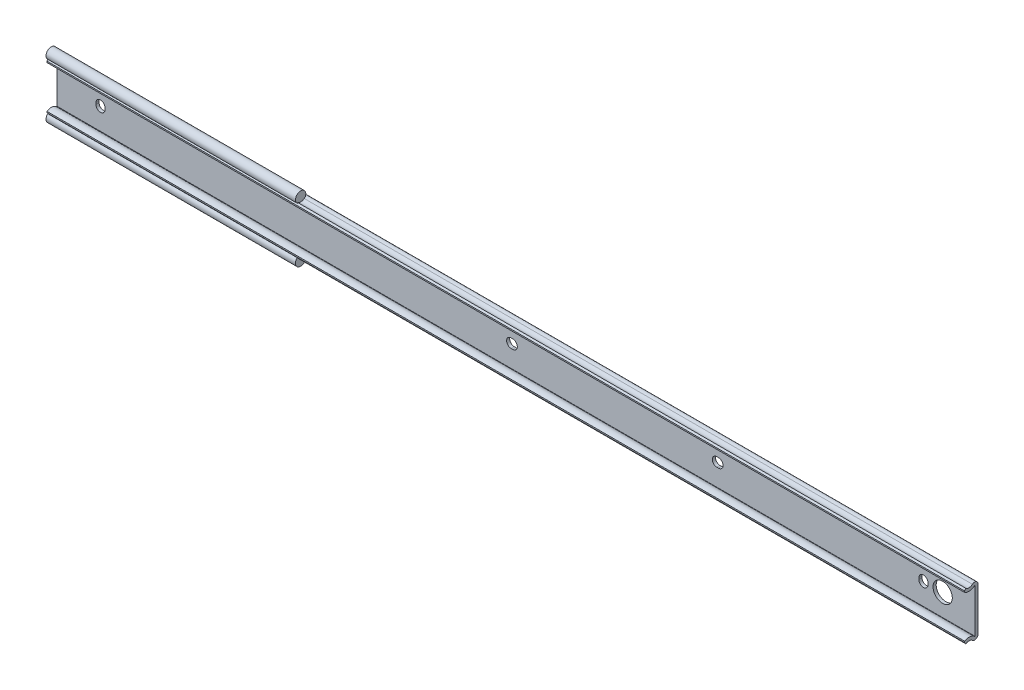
ISO-10303-21;
HEADER;
FILE_DESCRIPTION(('STEP AP214'),'2;1');
FILE_NAME('part.step','',(''),(''),'','','');
FILE_SCHEMA(('AUTOMOTIVE_DESIGN { 1 0 10303 214 1 1 1 1 }'));
ENDSEC;
DATA;
#1=APPLICATION_CONTEXT('core data for automotive mechanical design processes');
#2=APPLICATION_PROTOCOL_DEFINITION('international standard','automotive_design',2000,#1);
#3=PRODUCT_CONTEXT('',#1,'mechanical');
#4=PRODUCT('Part','Part','',(#3));
#5=PRODUCT_RELATED_PRODUCT_CATEGORY('part','',(#4));
#6=PRODUCT_DEFINITION_FORMATION('','',#4);
#7=PRODUCT_DEFINITION_CONTEXT('part definition',#1,'design');
#8=PRODUCT_DEFINITION('design','',#6,#7);
#9=PRODUCT_DEFINITION_SHAPE('','',#8);
#10=(LENGTH_UNIT() NAMED_UNIT(*) SI_UNIT(.MILLI.,.METRE.));
#11=(NAMED_UNIT(*) PLANE_ANGLE_UNIT() SI_UNIT($,.RADIAN.));
#12=(NAMED_UNIT(*) SI_UNIT($,.STERADIAN.) SOLID_ANGLE_UNIT());
#13=UNCERTAINTY_MEASURE_WITH_UNIT(LENGTH_MEASURE(1.E-05),#10,'distance_accuracy_value','');
#14=(GEOMETRIC_REPRESENTATION_CONTEXT(3) GLOBAL_UNCERTAINTY_ASSIGNED_CONTEXT((#13)) GLOBAL_UNIT_ASSIGNED_CONTEXT((#10,
#11,#12)) REPRESENTATION_CONTEXT('',''));
#15=CARTESIAN_POINT('',(0.,0.,0.));
#16=DIRECTION('',(0.,0.,1.));
#17=DIRECTION('',(1.,0.,0.));
#18=AXIS2_PLACEMENT_3D('',#15,#16,#17);
#19=CARTESIAN_POINT('',(105.8,13.575,4.5));
#20=DIRECTION('',(-1.,0.,0.));
#21=DIRECTION('',(0.,0.,1.));
#22=AXIS2_PLACEMENT_3D('',#19,#20,#21);
#23=CYLINDRICAL_SURFACE('',#22,2.55);
#24=DIRECTION('',(-1.,0.,0.));
#25=VECTOR('',#24,1.);
#26=CARTESIAN_POINT('',(105.8,11.6418409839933,6.16294805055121));
#27=LINE('',#26,#25);
#28=CARTESIAN_POINT('',(-21.4,11.6418409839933,6.16294805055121));
#29=VERTEX_POINT('',#28);
#30=CARTESIAN_POINT('',(101.8,11.6418409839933,6.16294805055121));
#31=VERTEX_POINT('',#30);
#32=EDGE_CURVE('E22',#29,#31,#27,.F.);
#33=ORIENTED_EDGE('',*,*,#32,.T.);
#34=CARTESIAN_POINT('',(101.8,13.575,4.5));
#35=DIRECTION('',(1.,0.,0.));
#36=DIRECTION('',(0.,0.,-1.));
#37=AXIS2_PLACEMENT_3D('',#34,#35,#36);
#38=CIRCLE('',#37,2.55);
#39=CARTESIAN_POINT('',(101.8,12.2965303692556,2.29364205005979));
#40=VERTEX_POINT('',#39);
#41=EDGE_CURVE('E244',#40,#31,#38,.T.);
#42=ORIENTED_EDGE('',*,*,#41,.F.);
#43=DIRECTION('',(-1.,0.,0.));
#44=VECTOR('',#43,1.);
#45=CARTESIAN_POINT('',(42.2,12.2965303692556,2.29364205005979));
#46=LINE('',#45,#44);
#47=CARTESIAN_POINT('',(-21.4,12.2965303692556,2.29364205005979));
#48=VERTEX_POINT('',#47);
#49=EDGE_CURVE('E457',#40,#48,#46,.T.);
#50=ORIENTED_EDGE('',*,*,#49,.T.);
#51=CARTESIAN_POINT('',(-21.4,13.575,4.5));
#52=DIRECTION('',(-1.,0.,0.));
#53=DIRECTION('',(0.,0.,1.));
#54=AXIS2_PLACEMENT_3D('',#51,#52,#53);
#55=CIRCLE('',#54,2.55);
#56=EDGE_CURVE('E253',#29,#48,#55,.T.);
#57=ORIENTED_EDGE('',*,*,#56,.F.);
#58=EDGE_LOOP('',(#33,#42,#50,#57));
#59=FACE_BOUND('',#58,.T.);
#60=ADVANCED_FACE('F14',(#59),#23,.T.);
#61=CARTESIAN_POINT('',(105.8,-13.575,4.5));
#62=DIRECTION('',(-1.,0.,0.));
#63=DIRECTION('',(0.,0.,1.));
#64=AXIS2_PLACEMENT_3D('',#61,#62,#63);
#65=CYLINDRICAL_SURFACE('',#64,2.55);
#66=DIRECTION('',(-1.,0.,0.));
#67=VECTOR('',#66,1.);
#68=CARTESIAN_POINT('',(42.2,-12.2965303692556,2.29364205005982));
#69=LINE('',#68,#67);
#70=CARTESIAN_POINT('',(-21.4,-12.2965303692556,2.29364205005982));
#71=VERTEX_POINT('',#70);
#72=CARTESIAN_POINT('',(101.8,-12.2965303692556,2.29364205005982));
#73=VERTEX_POINT('',#72);
#74=EDGE_CURVE('E480',#71,#73,#69,.F.);
#75=ORIENTED_EDGE('',*,*,#74,.T.);
#76=CARTESIAN_POINT('',(101.8,-13.575,4.5));
#77=DIRECTION('',(1.,0.,0.));
#78=DIRECTION('',(0.,0.,-1.));
#79=AXIS2_PLACEMENT_3D('',#76,#77,#78);
#80=CIRCLE('',#79,2.55);
#81=CARTESIAN_POINT('',(101.8,-11.641839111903,6.16294587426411));
#82=VERTEX_POINT('',#81);
#83=EDGE_CURVE('E492',#82,#73,#80,.T.);
#84=ORIENTED_EDGE('',*,*,#83,.F.);
#85=DIRECTION('',(-1.,0.,0.));
#86=VECTOR('',#85,1.);
#87=CARTESIAN_POINT('',(105.8,-11.641839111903,6.16294587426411));
#88=LINE('',#87,#86);
#89=CARTESIAN_POINT('',(-21.4,-11.641839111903,6.16294587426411));
#90=VERTEX_POINT('',#89);
#91=EDGE_CURVE('E9',#82,#90,#88,.T.);
#92=ORIENTED_EDGE('',*,*,#91,.T.);
#93=CARTESIAN_POINT('',(-21.4,-13.575,4.5));
#94=DIRECTION('',(-1.,0.,0.));
#95=DIRECTION('',(0.,0.,-1.));
#96=AXIS2_PLACEMENT_3D('',#93,#94,#95);
#97=CIRCLE('',#96,2.55);
#98=EDGE_CURVE('E483',#71,#90,#97,.T.);
#99=ORIENTED_EDGE('',*,*,#98,.F.);
#100=EDGE_LOOP('',(#75,#84,#92,#99));
#101=FACE_BOUND('',#100,.T.);
#102=ADVANCED_FACE('F514',(#101),#65,.T.);
#103=CARTESIAN_POINT('',(-21.4,13.9150000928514,4.44999970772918));
#104=DIRECTION('',(1.,0.,0.));
#105=DIRECTION('',(0.,0.,-1.));
#106=AXIS2_PLACEMENT_3D('',#103,#104,#105);
#107=CYLINDRICAL_SURFACE('',#106,2.55000008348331);
#108=DIRECTION('',(1.,0.,0.));
#109=VECTOR('',#108,1.);
#110=CARTESIAN_POINT('',(-21.4,12.0053612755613,2.76009438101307));
#111=LINE('',#110,#109);
#112=CARTESIAN_POINT('',(101.8,12.0053612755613,2.76009438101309));
#113=VERTEX_POINT('',#112);
#114=CARTESIAN_POINT('',(431.8,12.0053612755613,2.76009438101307));
#115=VERTEX_POINT('',#114);
#116=EDGE_CURVE('E297',#113,#115,#111,.T.);
#117=ORIENTED_EDGE('',*,*,#116,.F.);
#118=CARTESIAN_POINT('',(101.8,13.9150000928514,4.44999970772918));
#119=DIRECTION('',(1.,0.,0.));
#120=DIRECTION('',(0.,0.,-1.));
#121=AXIS2_PLACEMENT_3D('',#118,#119,#120);
#122=CIRCLE('',#121,2.5500000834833);
#123=CARTESIAN_POINT('',(101.8,11.8784794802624,5.98462807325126));
#124=VERTEX_POINT('',#123);
#125=EDGE_CURVE('E243',#124,#113,#122,.T.);
#126=ORIENTED_EDGE('',*,*,#125,.F.);
#127=DIRECTION('',(1.,0.,0.));
#128=VECTOR('',#127,1.);
#129=CARTESIAN_POINT('',(-21.4,11.8784794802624,5.98462807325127));
#130=LINE('',#129,#128);
#131=CARTESIAN_POINT('',(431.8,11.8784794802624,5.98462807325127));
#132=VERTEX_POINT('',#131);
#133=EDGE_CURVE('E241',#124,#132,#130,.T.);
#134=ORIENTED_EDGE('',*,*,#133,.T.);
#135=CARTESIAN_POINT('',(431.8,13.9150000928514,4.44999970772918));
#136=DIRECTION('',(-1.,0.,0.));
#137=DIRECTION('',(0.,0.,-1.));
#138=AXIS2_PLACEMENT_3D('',#135,#136,#137);
#139=CIRCLE('',#138,2.55000008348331);
#140=EDGE_CURVE('E391',#115,#132,#139,.T.);
#141=ORIENTED_EDGE('',*,*,#140,.F.);
#142=EDGE_LOOP('',(#117,#126,#134,#141));
#143=FACE_BOUND('',#142,.T.);
#144=ADVANCED_FACE('F512',(#143),#107,.F.);
#145=CARTESIAN_POINT('',(-21.4,10.762224,1.65999962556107));
#146=DIRECTION('',(1.,0.,0.));
#147=DIRECTION('',(0.,0.,-1.));
#148=AXIS2_PLACEMENT_3D('',#145,#146,#147);
#149=CYLINDRICAL_SURFACE('',#148,1.65999962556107);
#150=CARTESIAN_POINT('',(101.8,10.762224,1.65999962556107));
#151=DIRECTION('',(-1.,0.,0.));
#152=DIRECTION('',(0.,0.,-1.));
#153=AXIS2_PLACEMENT_3D('',#150,#151,#152);
#154=CIRCLE('',#153,1.65999962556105);
#155=EDGE_CURVE('E29',#113,#40,#154,.T.);
#156=ORIENTED_EDGE('',*,*,#155,.F.);
#157=ORIENTED_EDGE('',*,*,#116,.T.);
#158=CARTESIAN_POINT('',(431.8,10.762224,1.65999962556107));
#159=DIRECTION('',(1.,0.,0.));
#160=DIRECTION('',(0.,0.,-1.));
#161=AXIS2_PLACEMENT_3D('',#158,#159,#160);
#162=CIRCLE('',#161,1.65999962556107);
#163=CARTESIAN_POINT('',(431.8,10.762224,0.));
#164=VERTEX_POINT('',#163);
#165=EDGE_CURVE('E260',#164,#115,#162,.T.);
#166=ORIENTED_EDGE('',*,*,#165,.F.);
#167=DIRECTION('',(1.,0.,0.));
#168=VECTOR('',#167,1.);
#169=CARTESIAN_POINT('',(-21.4,10.762224,0.));
#170=LINE('',#169,#168);
#171=CARTESIAN_POINT('',(-21.4,10.762224,0.));
#172=VERTEX_POINT('',#171);
#173=EDGE_CURVE('E296',#172,#164,#170,.T.);
#174=ORIENTED_EDGE('',*,*,#173,.F.);
#175=CARTESIAN_POINT('',(-21.4,10.762224,1.65999962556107));
#176=DIRECTION('',(1.,0.,0.));
#177=DIRECTION('',(0.,0.,-1.));
#178=AXIS2_PLACEMENT_3D('',#175,#176,#177);
#179=CIRCLE('',#178,1.65999962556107);
#180=EDGE_CURVE('E352',#172,#48,#179,.T.);
#181=ORIENTED_EDGE('',*,*,#180,.T.);
#182=ORIENTED_EDGE('',*,*,#49,.F.);
#183=EDGE_LOOP('',(#156,#157,#166,#174,#181,#182));
#184=FACE_BOUND('',#183,.T.);
#185=ADVANCED_FACE('F16',(#184),#149,.T.);
#186=CARTESIAN_POINT('',(-21.4,-10.762224,0.));
#187=DIRECTION('',(0.,0.,-1.));
#188=DIRECTION('',(-1.,0.,0.));
#189=AXIS2_PLACEMENT_3D('',#186,#187,#188);
#190=PLANE('',#189);
#191=CARTESIAN_POINT('',(415.9,0.,0.));
#192=DIRECTION('',(0.,0.,-1.));
#193=DIRECTION('',(-1.,0.,0.));
#194=AXIS2_PLACEMENT_3D('',#191,#192,#193);
#195=CIRCLE('',#194,4.75);
#196=CARTESIAN_POINT('',(411.15,0.,0.));
#197=VERTEX_POINT('',#196);
#198=EDGE_CURVE('E261',#197,#197,#195,.T.);
#199=ORIENTED_EDGE('',*,*,#198,.F.);
#200=EDGE_LOOP('',(#199));
#201=FACE_BOUND('',#200,.T.);
#202=CARTESIAN_POINT('',(203.6,0.,0.));
#203=DIRECTION('',(0.,0.,-1.));
#204=DIRECTION('',(-1.,0.,0.));
#205=AXIS2_PLACEMENT_3D('',#202,#203,#204);
#206=CIRCLE('',#205,2.25);
#207=CARTESIAN_POINT('',(203.6,2.25,0.));
#208=VERTEX_POINT('',#207);
#209=CARTESIAN_POINT('',(203.6,-2.25,0.));
#210=VERTEX_POINT('',#209);
#211=EDGE_CURVE('E455',#208,#210,#206,.T.);
#212=ORIENTED_EDGE('',*,*,#211,.F.);
#213=DIRECTION('',(1.,0.,0.));
#214=VECTOR('',#213,1.);
#215=CARTESIAN_POINT('',(203.6,2.25,0.));
#216=LINE('',#215,#214);
#217=CARTESIAN_POINT('',(202.8,2.25,0.));
#218=VERTEX_POINT('',#217);
#219=EDGE_CURVE('E440',#218,#208,#216,.T.);
#220=ORIENTED_EDGE('',*,*,#219,.F.);
#221=CARTESIAN_POINT('',(202.8,0.,0.));
#222=DIRECTION('',(0.,0.,-1.));
#223=DIRECTION('',(-1.,0.,0.));
#224=AXIS2_PLACEMENT_3D('',#221,#222,#223);
#225=CIRCLE('',#224,2.25);
#226=CARTESIAN_POINT('',(202.8,-2.25,0.));
#227=VERTEX_POINT('',#226);
#228=EDGE_CURVE('E449',#227,#218,#225,.T.);
#229=ORIENTED_EDGE('',*,*,#228,.F.);
#230=DIRECTION('',(-1.,0.,0.));
#231=VECTOR('',#230,1.);
#232=CARTESIAN_POINT('',(203.6,-2.25,0.));
#233=LINE('',#232,#231);
#234=EDGE_CURVE('E452',#210,#227,#233,.T.);
#235=ORIENTED_EDGE('',*,*,#234,.F.);
#236=EDGE_LOOP('',(#212,#220,#229,#235));
#237=FACE_BOUND('',#236,.T.);
#238=CARTESIAN_POINT('',(305.2,0.,0.));
#239=DIRECTION('',(0.,0.,-1.));
#240=DIRECTION('',(-1.,0.,0.));
#241=AXIS2_PLACEMENT_3D('',#238,#239,#240);
#242=CIRCLE('',#241,2.25);
#243=CARTESIAN_POINT('',(305.2,2.25,0.));
#244=VERTEX_POINT('',#243);
#245=CARTESIAN_POINT('',(305.2,-2.25,0.));
#246=VERTEX_POINT('',#245);
#247=EDGE_CURVE('E446',#244,#246,#242,.T.);
#248=ORIENTED_EDGE('',*,*,#247,.F.);
#249=DIRECTION('',(1.,0.,0.));
#250=VECTOR('',#249,1.);
#251=CARTESIAN_POINT('',(305.2,2.25,0.));
#252=LINE('',#251,#250);
#253=CARTESIAN_POINT('',(304.4,2.25,0.));
#254=VERTEX_POINT('',#253);
#255=EDGE_CURVE('E462',#254,#244,#252,.T.);
#256=ORIENTED_EDGE('',*,*,#255,.F.);
#257=CARTESIAN_POINT('',(304.4,0.,0.));
#258=DIRECTION('',(0.,0.,-1.));
#259=DIRECTION('',(-1.,0.,0.));
#260=AXIS2_PLACEMENT_3D('',#257,#258,#259);
#261=CIRCLE('',#260,2.25);
#262=CARTESIAN_POINT('',(304.4,-2.25,0.));
#263=VERTEX_POINT('',#262);
#264=EDGE_CURVE('E469',#263,#254,#261,.T.);
#265=ORIENTED_EDGE('',*,*,#264,.F.);
#266=DIRECTION('',(-1.,0.,0.));
#267=VECTOR('',#266,1.);
#268=CARTESIAN_POINT('',(305.2,-2.25,0.));
#269=LINE('',#268,#267);
#270=EDGE_CURVE('E472',#246,#263,#269,.T.);
#271=ORIENTED_EDGE('',*,*,#270,.F.);
#272=EDGE_LOOP('',(#248,#256,#265,#271));
#273=FACE_BOUND('',#272,.T.);
#274=CARTESIAN_POINT('',(0.,0.4,0.));
#275=DIRECTION('',(0.,0.,-1.));
#276=DIRECTION('',(-1.,0.,0.));
#277=AXIS2_PLACEMENT_3D('',#274,#275,#276);
#278=CIRCLE('',#277,2.24999999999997);
#279=CARTESIAN_POINT('',(-2.24999999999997,0.4,0.));
#280=VERTEX_POINT('',#279);
#281=CARTESIAN_POINT('',(2.24999999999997,0.4,0.));
#282=VERTEX_POINT('',#281);
#283=EDGE_CURVE('E414',#280,#282,#278,.T.);
#284=ORIENTED_EDGE('',*,*,#283,.F.);
#285=DIRECTION('',(0.,1.,0.));
#286=VECTOR('',#285,1.);
#287=CARTESIAN_POINT('',(-2.24999999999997,0.4,0.));
#288=LINE('',#287,#286);
#289=CARTESIAN_POINT('',(-2.24999999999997,-0.4,0.));
#290=VERTEX_POINT('',#289);
#291=EDGE_CURVE('E399',#290,#280,#288,.T.);
#292=ORIENTED_EDGE('',*,*,#291,.F.);
#293=CARTESIAN_POINT('',(0.,-0.4,0.));
#294=DIRECTION('',(0.,0.,-1.));
#295=DIRECTION('',(-1.,0.,0.));
#296=AXIS2_PLACEMENT_3D('',#293,#294,#295);
#297=CIRCLE('',#296,2.24999999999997);
#298=CARTESIAN_POINT('',(2.24999999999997,-0.4,0.));
#299=VERTEX_POINT('',#298);
#300=EDGE_CURVE('E408',#299,#290,#297,.T.);
#301=ORIENTED_EDGE('',*,*,#300,.F.);
#302=DIRECTION('',(0.,-1.,0.));
#303=VECTOR('',#302,1.);
#304=CARTESIAN_POINT('',(2.24999999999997,0.4,0.));
#305=LINE('',#304,#303);
#306=EDGE_CURVE('E411',#282,#299,#305,.T.);
#307=ORIENTED_EDGE('',*,*,#306,.F.);
#308=EDGE_LOOP('',(#284,#292,#301,#307));
#309=FACE_BOUND('',#308,.T.);
#310=CARTESIAN_POINT('',(406.4,0.4,0.));
#311=DIRECTION('',(0.,0.,-1.));
#312=DIRECTION('',(-1.,0.,0.));
#313=AXIS2_PLACEMENT_3D('',#310,#311,#312);
#314=CIRCLE('',#313,2.25);
#315=CARTESIAN_POINT('',(404.15,0.4,0.));
#316=VERTEX_POINT('',#315);
#317=CARTESIAN_POINT('',(408.65,0.4,0.));
#318=VERTEX_POINT('',#317);
#319=EDGE_CURVE('E405',#316,#318,#314,.T.);
#320=ORIENTED_EDGE('',*,*,#319,.F.);
#321=DIRECTION('',(0.,1.,0.));
#322=VECTOR('',#321,1.);
#323=CARTESIAN_POINT('',(404.15,0.4,0.));
#324=LINE('',#323,#322);
#325=CARTESIAN_POINT('',(404.15,-0.4,0.));
#326=VERTEX_POINT('',#325);
#327=EDGE_CURVE('E421',#326,#316,#324,.T.);
#328=ORIENTED_EDGE('',*,*,#327,.F.);
#329=CARTESIAN_POINT('',(406.4,-0.4,0.));
#330=DIRECTION('',(0.,0.,-1.));
#331=DIRECTION('',(-1.,0.,0.));
#332=AXIS2_PLACEMENT_3D('',#329,#330,#331);
#333=CIRCLE('',#332,2.25);
#334=CARTESIAN_POINT('',(408.65,-0.4,0.));
#335=VERTEX_POINT('',#334);
#336=EDGE_CURVE('E429',#335,#326,#333,.T.);
#337=ORIENTED_EDGE('',*,*,#336,.F.);
#338=DIRECTION('',(0.,-1.,0.));
#339=VECTOR('',#338,1.);
#340=CARTESIAN_POINT('',(408.65,0.4,0.));
#341=LINE('',#340,#339);
#342=EDGE_CURVE('E432',#318,#335,#341,.T.);
#343=ORIENTED_EDGE('',*,*,#342,.F.);
#344=EDGE_LOOP('',(#320,#328,#337,#343));
#345=FACE_BOUND('',#344,.T.);
#346=DIRECTION('',(0.,1.,0.));
#347=VECTOR('',#346,1.);
#348=CARTESIAN_POINT('',(-21.4,-10.762224,0.));
#349=LINE('',#348,#347);
#350=CARTESIAN_POINT('',(-21.4,-10.762224,0.));
#351=VERTEX_POINT('',#350);
#352=EDGE_CURVE('E300',#351,#172,#349,.T.);
#353=ORIENTED_EDGE('',*,*,#352,.T.);
#354=ORIENTED_EDGE('',*,*,#173,.T.);
#355=DIRECTION('',(0.,1.,0.));
#356=VECTOR('',#355,1.);
#357=CARTESIAN_POINT('',(431.8,-10.762224,0.));
#358=LINE('',#357,#356);
#359=CARTESIAN_POINT('',(431.8,-10.762224,0.));
#360=VERTEX_POINT('',#359);
#361=EDGE_CURVE('E355',#360,#164,#358,.T.);
#362=ORIENTED_EDGE('',*,*,#361,.F.);
#363=DIRECTION('',(1.,0.,0.));
#364=VECTOR('',#363,1.);
#365=CARTESIAN_POINT('',(-21.4,-10.762224,0.));
#366=LINE('',#365,#364);
#367=EDGE_CURVE('E322',#351,#360,#366,.T.);
#368=ORIENTED_EDGE('',*,*,#367,.F.);
#369=EDGE_LOOP('',(#353,#354,#362,#368));
#370=FACE_BOUND('',#369,.T.);
#371=ADVANCED_FACE('F520',(#201,#237,#273,#309,#345,#370),#190,.T.);
#372=CARTESIAN_POINT('',(-21.4,-10.762224,1.65999962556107));
#373=DIRECTION('',(1.,0.,0.));
#374=DIRECTION('',(0.,0.,-1.));
#375=AXIS2_PLACEMENT_3D('',#372,#373,#374);
#376=CYLINDRICAL_SURFACE('',#375,1.65999962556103);
#377=ORIENTED_EDGE('',*,*,#74,.F.);
#378=CARTESIAN_POINT('',(-21.4,-10.762224,1.65999962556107));
#379=DIRECTION('',(1.,0.,0.));
#380=DIRECTION('',(0.,0.,1.));
#381=AXIS2_PLACEMENT_3D('',#378,#379,#380);
#382=CIRCLE('',#381,1.65999962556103);
#383=EDGE_CURVE('E37',#71,#351,#382,.T.);
#384=ORIENTED_EDGE('',*,*,#383,.T.);
#385=ORIENTED_EDGE('',*,*,#367,.T.);
#386=CARTESIAN_POINT('',(431.8,-10.762224,1.65999962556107));
#387=DIRECTION('',(1.,0.,0.));
#388=DIRECTION('',(0.,0.,1.));
#389=AXIS2_PLACEMENT_3D('',#386,#387,#388);
#390=CIRCLE('',#389,1.65999962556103);
#391=CARTESIAN_POINT('',(431.8,-12.0036867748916,2.76198371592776));
#392=VERTEX_POINT('',#391);
#393=EDGE_CURVE('E358',#392,#360,#390,.T.);
#394=ORIENTED_EDGE('',*,*,#393,.F.);
#395=DIRECTION('',(1.,0.,0.));
#396=VECTOR('',#395,1.);
#397=CARTESIAN_POINT('',(-21.4,-12.0036867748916,2.76198371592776));
#398=LINE('',#397,#396);
#399=CARTESIAN_POINT('',(101.8,-12.0036867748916,2.76198371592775));
#400=VERTEX_POINT('',#399);
#401=EDGE_CURVE('E320',#400,#392,#398,.T.);
#402=ORIENTED_EDGE('',*,*,#401,.F.);
#403=CARTESIAN_POINT('',(101.8,-10.762224,1.65999962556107));
#404=DIRECTION('',(-1.,0.,0.));
#405=DIRECTION('',(0.,0.,-1.));
#406=AXIS2_PLACEMENT_3D('',#403,#404,#405);
#407=CIRCLE('',#406,1.65999962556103);
#408=EDGE_CURVE('E489',#73,#400,#407,.T.);
#409=ORIENTED_EDGE('',*,*,#408,.F.);
#410=EDGE_LOOP('',(#377,#384,#385,#394,#402,#409));
#411=FACE_BOUND('',#410,.T.);
#412=ADVANCED_FACE('F607',(#411),#376,.T.);
#413=CARTESIAN_POINT('',(-21.4,-10.7845049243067,1.54999983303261));
#414=DIRECTION('',(0.,0.,1.));
#415=DIRECTION('',(0.,-1.,0.));
#416=AXIS2_PLACEMENT_3D('',#413,#414,#415);
#417=PLANE('',#416);
#418=CARTESIAN_POINT('',(415.9,0.,1.54999983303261));
#419=DIRECTION('',(0.,0.,1.));
#420=DIRECTION('',(0.,-1.,0.));
#421=AXIS2_PLACEMENT_3D('',#418,#419,#420);
#422=CIRCLE('',#421,4.75);
#423=CARTESIAN_POINT('',(415.9,-4.75,1.54999983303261));
#424=VERTEX_POINT('',#423);
#425=EDGE_CURVE('E258',#424,#424,#422,.T.);
#426=ORIENTED_EDGE('',*,*,#425,.F.);
#427=EDGE_LOOP('',(#426));
#428=FACE_BOUND('',#427,.T.);
#429=CARTESIAN_POINT('',(203.6,0.,1.54999983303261));
#430=DIRECTION('',(0.,0.,1.));
#431=DIRECTION('',(0.,-1.,0.));
#432=AXIS2_PLACEMENT_3D('',#429,#430,#431);
#433=CIRCLE('',#432,2.25);
#434=CARTESIAN_POINT('',(203.6,-2.25,1.54999983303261));
#435=VERTEX_POINT('',#434);
#436=CARTESIAN_POINT('',(203.6,2.25,1.54999983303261));
#437=VERTEX_POINT('',#436);
#438=EDGE_CURVE('E254',#435,#437,#433,.T.);
#439=ORIENTED_EDGE('',*,*,#438,.F.);
#440=DIRECTION('',(1.,0.,0.));
#441=VECTOR('',#440,1.);
#442=CARTESIAN_POINT('',(-21.4,-2.25,1.54999983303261));
#443=LINE('',#442,#441);
#444=CARTESIAN_POINT('',(202.8,-2.25,1.54999983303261));
#445=VERTEX_POINT('',#444);
#446=EDGE_CURVE('E267',#445,#435,#443,.T.);
#447=ORIENTED_EDGE('',*,*,#446,.F.);
#448=CARTESIAN_POINT('',(202.8,0.,1.54999983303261));
#449=DIRECTION('',(0.,0.,1.));
#450=DIRECTION('',(0.,-1.,0.));
#451=AXIS2_PLACEMENT_3D('',#448,#449,#450);
#452=CIRCLE('',#451,2.25);
#453=CARTESIAN_POINT('',(202.8,2.25,1.54999983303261));
#454=VERTEX_POINT('',#453);
#455=EDGE_CURVE('E264',#454,#445,#452,.T.);
#456=ORIENTED_EDGE('',*,*,#455,.F.);
#457=DIRECTION('',(-1.,0.,0.));
#458=VECTOR('',#457,1.);
#459=CARTESIAN_POINT('',(-21.4,2.25,1.54999983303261));
#460=LINE('',#459,#458);
#461=EDGE_CURVE('E255',#437,#454,#460,.T.);
#462=ORIENTED_EDGE('',*,*,#461,.F.);
#463=EDGE_LOOP('',(#439,#447,#456,#462));
#464=FACE_BOUND('',#463,.T.);
#465=CARTESIAN_POINT('',(305.2,0.,1.54999983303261));
#466=DIRECTION('',(0.,0.,1.));
#467=DIRECTION('',(0.,-1.,0.));
#468=AXIS2_PLACEMENT_3D('',#465,#466,#467);
#469=CIRCLE('',#468,2.25);
#470=CARTESIAN_POINT('',(305.2,-2.25,1.54999983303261));
#471=VERTEX_POINT('',#470);
#472=CARTESIAN_POINT('',(305.2,2.25,1.54999983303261));
#473=VERTEX_POINT('',#472);
#474=EDGE_CURVE('E269',#471,#473,#469,.T.);
#475=ORIENTED_EDGE('',*,*,#474,.F.);
#476=DIRECTION('',(1.,0.,0.));
#477=VECTOR('',#476,1.);
#478=CARTESIAN_POINT('',(-21.4,-2.25,1.54999983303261));
#479=LINE('',#478,#477);
#480=CARTESIAN_POINT('',(304.4,-2.25,1.54999983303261));
#481=VERTEX_POINT('',#480);
#482=EDGE_CURVE('E276',#481,#471,#479,.T.);
#483=ORIENTED_EDGE('',*,*,#482,.F.);
#484=CARTESIAN_POINT('',(304.4,0.,1.54999983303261));
#485=DIRECTION('',(0.,0.,1.));
#486=DIRECTION('',(0.,-1.,0.));
#487=AXIS2_PLACEMENT_3D('',#484,#485,#486);
#488=CIRCLE('',#487,2.25);
#489=CARTESIAN_POINT('',(304.4,2.25,1.54999983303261));
#490=VERTEX_POINT('',#489);
#491=EDGE_CURVE('E273',#490,#481,#488,.T.);
#492=ORIENTED_EDGE('',*,*,#491,.F.);
#493=DIRECTION('',(-1.,0.,0.));
#494=VECTOR('',#493,1.);
#495=CARTESIAN_POINT('',(-21.4,2.25000000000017,1.54999983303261));
#496=LINE('',#495,#494);
#497=EDGE_CURVE('E271',#473,#490,#496,.T.);
#498=ORIENTED_EDGE('',*,*,#497,.F.);
#499=EDGE_LOOP('',(#475,#483,#492,#498));
#500=FACE_BOUND('',#499,.T.);
#501=CARTESIAN_POINT('',(0.,0.4,1.54999983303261));
#502=DIRECTION('',(0.,0.,1.));
#503=DIRECTION('',(0.,-1.,0.));
#504=AXIS2_PLACEMENT_3D('',#501,#502,#503);
#505=CIRCLE('',#504,2.24999999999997);
#506=CARTESIAN_POINT('',(2.24999999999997,0.4,1.54999983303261));
#507=VERTEX_POINT('',#506);
#508=CARTESIAN_POINT('',(-2.24999999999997,0.4,1.54999983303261));
#509=VERTEX_POINT('',#508);
#510=EDGE_CURVE('E278',#507,#509,#505,.T.);
#511=ORIENTED_EDGE('',*,*,#510,.F.);
#512=DIRECTION('',(0.,1.,0.));
#513=VECTOR('',#512,1.);
#514=CARTESIAN_POINT('',(2.24999999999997,-10.7845049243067,1.54999983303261));
#515=LINE('',#514,#513);
#516=CARTESIAN_POINT('',(2.24999999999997,-0.4,1.54999983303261));
#517=VERTEX_POINT('',#516);
#518=EDGE_CURVE('E285',#517,#507,#515,.T.);
#519=ORIENTED_EDGE('',*,*,#518,.F.);
#520=CARTESIAN_POINT('',(0.,-0.4,1.54999983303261));
#521=DIRECTION('',(0.,0.,1.));
#522=DIRECTION('',(0.,-1.,0.));
#523=AXIS2_PLACEMENT_3D('',#520,#521,#522);
#524=CIRCLE('',#523,2.24999999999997);
#525=CARTESIAN_POINT('',(-2.24999999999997,-0.4,1.54999983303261));
#526=VERTEX_POINT('',#525);
#527=EDGE_CURVE('E282',#526,#517,#524,.T.);
#528=ORIENTED_EDGE('',*,*,#527,.F.);
#529=DIRECTION('',(0.,-1.,0.));
#530=VECTOR('',#529,1.);
#531=CARTESIAN_POINT('',(-2.24999999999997,-10.7845049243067,1.54999983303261));
#532=LINE('',#531,#530);
#533=EDGE_CURVE('E280',#509,#526,#532,.T.);
#534=ORIENTED_EDGE('',*,*,#533,.F.);
#535=EDGE_LOOP('',(#511,#519,#528,#534));
#536=FACE_BOUND('',#535,.T.);
#537=CARTESIAN_POINT('',(406.4,0.4,1.54999983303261));
#538=DIRECTION('',(0.,0.,1.));
#539=DIRECTION('',(0.,-1.,0.));
#540=AXIS2_PLACEMENT_3D('',#537,#538,#539);
#541=CIRCLE('',#540,2.25);
#542=CARTESIAN_POINT('',(408.65,0.4,1.54999983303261));
#543=VERTEX_POINT('',#542);
#544=CARTESIAN_POINT('',(404.15,0.4,1.54999983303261));
#545=VERTEX_POINT('',#544);
#546=EDGE_CURVE('E287',#543,#545,#541,.T.);
#547=ORIENTED_EDGE('',*,*,#546,.F.);
#548=DIRECTION('',(0.,1.,0.));
#549=VECTOR('',#548,1.);
#550=CARTESIAN_POINT('',(408.65,-10.7845049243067,1.54999983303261));
#551=LINE('',#550,#549);
#552=CARTESIAN_POINT('',(408.65,-0.4,1.54999983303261));
#553=VERTEX_POINT('',#552);
#554=EDGE_CURVE('E294',#553,#543,#551,.T.);
#555=ORIENTED_EDGE('',*,*,#554,.F.);
#556=CARTESIAN_POINT('',(406.4,-0.4,1.54999983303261));
#557=DIRECTION('',(0.,0.,1.));
#558=DIRECTION('',(0.,-1.,0.));
#559=AXIS2_PLACEMENT_3D('',#556,#557,#558);
#560=CIRCLE('',#559,2.25);
#561=CARTESIAN_POINT('',(404.15,-0.4,1.54999983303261));
#562=VERTEX_POINT('',#561);
#563=EDGE_CURVE('E291',#562,#553,#560,.T.);
#564=ORIENTED_EDGE('',*,*,#563,.F.);
#565=DIRECTION('',(0.,-1.,0.));
#566=VECTOR('',#565,1.);
#567=CARTESIAN_POINT('',(404.15,-10.7845049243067,1.54999983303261));
#568=LINE('',#567,#566);
#569=EDGE_CURVE('E289',#545,#562,#568,.T.);
#570=ORIENTED_EDGE('',*,*,#569,.F.);
#571=EDGE_LOOP('',(#547,#555,#564,#570));
#572=FACE_BOUND('',#571,.T.);
#573=DIRECTION('',(0.,-1.,0.));
#574=VECTOR('',#573,1.);
#575=CARTESIAN_POINT('',(-21.4,-10.7845049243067,1.54999983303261));
#576=LINE('',#575,#574);
#577=CARTESIAN_POINT('',(-21.4,10.7845049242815,1.54999983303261));
#578=VERTEX_POINT('',#577);
#579=CARTESIAN_POINT('',(-21.4,-10.7845049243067,1.54999983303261));
#580=VERTEX_POINT('',#579);
#581=EDGE_CURVE('E339',#578,#580,#576,.T.);
#582=ORIENTED_EDGE('',*,*,#581,.T.);
#583=DIRECTION('',(1.,0.,0.));
#584=VECTOR('',#583,1.);
#585=CARTESIAN_POINT('',(-21.4,-10.7845049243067,1.54999983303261));
#586=LINE('',#585,#584);
#587=CARTESIAN_POINT('',(431.8,-10.7845049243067,1.54999983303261));
#588=VERTEX_POINT('',#587);
#589=EDGE_CURVE('E310',#580,#588,#586,.T.);
#590=ORIENTED_EDGE('',*,*,#589,.T.);
#591=DIRECTION('',(0.,-1.,0.));
#592=VECTOR('',#591,1.);
#593=CARTESIAN_POINT('',(431.8,-10.7845049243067,1.54999983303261));
#594=LINE('',#593,#592);
#595=CARTESIAN_POINT('',(431.8,10.7845049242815,1.54999983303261));
#596=VERTEX_POINT('',#595);
#597=EDGE_CURVE('E376',#596,#588,#594,.T.);
#598=ORIENTED_EDGE('',*,*,#597,.F.);
#599=DIRECTION('',(1.,0.,0.));
#600=VECTOR('',#599,1.);
#601=CARTESIAN_POINT('',(-21.4,10.7845049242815,1.54999983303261));
#602=LINE('',#601,#600);
#603=EDGE_CURVE('E308',#578,#596,#602,.T.);
#604=ORIENTED_EDGE('',*,*,#603,.F.);
#605=EDGE_LOOP('',(#582,#590,#598,#604));
#606=FACE_BOUND('',#605,.T.);
#607=ADVANCED_FACE('F604',(#428,#464,#500,#536,#572,#606),#417,.T.);
#608=CARTESIAN_POINT('',(-21.4,10.762224,1.65999962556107));
#609=DIRECTION('',(1.,0.,0.));
#610=DIRECTION('',(0.,0.,-1.));
#611=AXIS2_PLACEMENT_3D('',#608,#609,#610);
#612=PLANE('',#611);
#613=ORIENTED_EDGE('',*,*,#383,.F.);
#614=ORIENTED_EDGE('',*,*,#98,.T.);
#615=DIRECTION('',(0.,-0.798635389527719,-0.601815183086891));
#616=VECTOR('',#615,1.);
#617=CARTESIAN_POINT('',(-21.4,-11.8784773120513,5.98462612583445));
#618=LINE('',#617,#616);
#619=CARTESIAN_POINT('',(-21.4,-11.0618545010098,6.59999580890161));
#620=VERTEX_POINT('',#619);
#621=EDGE_CURVE('E327',#620,#90,#618,.T.);
#622=ORIENTED_EDGE('',*,*,#621,.F.);
#623=DIRECTION('',(0.,-1.,0.));
#624=VECTOR('',#623,1.);
#625=CARTESIAN_POINT('',(-21.4,-11.0618545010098,6.59999580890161));
#626=LINE('',#625,#624);
#627=CARTESIAN_POINT('',(-21.4,-10.4239404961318,6.59999580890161));
#628=VERTEX_POINT('',#627);
#629=EDGE_CURVE('E330',#628,#620,#626,.T.);
#630=ORIENTED_EDGE('',*,*,#629,.F.);
#631=CARTESIAN_POINT('',(-21.4,-13.9149976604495,4.44999754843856));
#632=DIRECTION('',(1.,0.,0.));
#633=DIRECTION('',(0.,0.,1.));
#634=AXIS2_PLACEMENT_3D('',#631,#632,#633);
#635=CIRCLE('',#634,4.09999666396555);
#636=CARTESIAN_POINT('',(-21.4,-10.8590405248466,1.71666649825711));
#637=VERTEX_POINT('',#636);
#638=EDGE_CURVE('E333',#637,#628,#635,.T.);
#639=ORIENTED_EDGE('',*,*,#638,.F.);
#640=CARTESIAN_POINT('',(-21.4,-10.7845049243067,1.64999983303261));
#641=DIRECTION('',(-1.,0.,0.));
#642=DIRECTION('',(0.,0.,-1.));
#643=AXIS2_PLACEMENT_3D('',#640,#641,#642);
#644=CIRCLE('',#643,0.1);
#645=EDGE_CURVE('E336',#580,#637,#644,.T.);
#646=ORIENTED_EDGE('',*,*,#645,.F.);
#647=ORIENTED_EDGE('',*,*,#581,.F.);
#648=CARTESIAN_POINT('',(-21.4,10.7845049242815,1.64999983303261));
#649=DIRECTION('',(-1.,0.,0.));
#650=DIRECTION('',(0.,0.,1.));
#651=AXIS2_PLACEMENT_3D('',#648,#649,#650);
#652=CIRCLE('',#651,0.1);
#653=CARTESIAN_POINT('',(-21.4,10.8590405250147,1.71666649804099));
#654=VERTEX_POINT('',#653);
#655=EDGE_CURVE('E341',#654,#578,#652,.T.);
#656=ORIENTED_EDGE('',*,*,#655,.F.);
#657=CARTESIAN_POINT('',(-21.4,13.9150000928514,4.44999970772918));
#658=DIRECTION('',(1.,0.,0.));
#659=DIRECTION('',(0.,0.,-1.));
#660=AXIS2_PLACEMENT_3D('',#657,#658,#659);
#661=CIRCLE('',#660,4.09999991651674);
#662=CARTESIAN_POINT('',(-21.4,10.4239401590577,6.59999967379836));
#663=VERTEX_POINT('',#662);
#664=EDGE_CURVE('E344',#663,#654,#661,.T.);
#665=ORIENTED_EDGE('',*,*,#664,.F.);
#666=DIRECTION('',(0.,-1.,1.54366169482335E-08));
#667=VECTOR('',#666,1.);
#668=CARTESIAN_POINT('',(-21.4,11.0618541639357,6.59999966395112));
#669=LINE('',#668,#667);
#670=CARTESIAN_POINT('',(-21.4,11.0618541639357,6.59999966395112));
#671=VERTEX_POINT('',#670);
#672=EDGE_CURVE('E347',#671,#663,#669,.T.);
#673=ORIENTED_EDGE('',*,*,#672,.F.);
#674=DIRECTION('',(0.,-0.798635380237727,0.601815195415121));
#675=VECTOR('',#674,1.);
#676=CARTESIAN_POINT('',(-21.4,11.8784794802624,5.98462807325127));
#677=LINE('',#676,#675);
#678=EDGE_CURVE('E350',#29,#671,#677,.T.);
#679=ORIENTED_EDGE('',*,*,#678,.F.);
#680=ORIENTED_EDGE('',*,*,#56,.T.);
#681=ORIENTED_EDGE('',*,*,#180,.F.);
#682=ORIENTED_EDGE('',*,*,#352,.F.);
#683=EDGE_LOOP('',(#613,#614,#622,#630,#639,#646,#647,#656,#665,#673,#679,#680,#681,#682));
#684=FACE_BOUND('',#683,.T.);
#685=ADVANCED_FACE('F502',(#684),#612,.F.);
#686=CARTESIAN_POINT('',(431.8,10.762224,1.65999962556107));
#687=DIRECTION('',(1.,0.,0.));
#688=DIRECTION('',(0.,0.,-1.));
#689=AXIS2_PLACEMENT_3D('',#686,#687,#688);
#690=PLANE('',#689);
#691=CARTESIAN_POINT('',(431.8,-13.9149976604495,4.44999754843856));
#692=DIRECTION('',(-1.,0.,0.));
#693=DIRECTION('',(0.,0.,1.));
#694=AXIS2_PLACEMENT_3D('',#691,#692,#693);
#695=CIRCLE('',#694,2.55000000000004);
#696=CARTESIAN_POINT('',(431.8,-11.8784773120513,5.98462612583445));
#697=VERTEX_POINT('',#696);
#698=EDGE_CURVE('E361',#697,#392,#695,.T.);
#699=ORIENTED_EDGE('',*,*,#698,.T.);
#700=ORIENTED_EDGE('',*,*,#393,.T.);
#701=ORIENTED_EDGE('',*,*,#361,.T.);
#702=ORIENTED_EDGE('',*,*,#165,.T.);
#703=ORIENTED_EDGE('',*,*,#140,.T.);
#704=DIRECTION('',(0.,-0.798635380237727,0.601815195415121));
#705=VECTOR('',#704,1.);
#706=CARTESIAN_POINT('',(431.8,11.8784794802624,5.98462807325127));
#707=LINE('',#706,#705);
#708=CARTESIAN_POINT('',(431.8,11.0618541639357,6.59999966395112));
#709=VERTEX_POINT('',#708);
#710=EDGE_CURVE('E388',#132,#709,#707,.T.);
#711=ORIENTED_EDGE('',*,*,#710,.T.);
#712=DIRECTION('',(0.,-1.,1.54366169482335E-08));
#713=VECTOR('',#712,1.);
#714=CARTESIAN_POINT('',(431.8,11.0618541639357,6.59999966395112));
#715=LINE('',#714,#713);
#716=CARTESIAN_POINT('',(431.8,10.4239401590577,6.59999967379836));
#717=VERTEX_POINT('',#716);
#718=EDGE_CURVE('E385',#709,#717,#715,.T.);
#719=ORIENTED_EDGE('',*,*,#718,.T.);
#720=CARTESIAN_POINT('',(431.8,13.9150000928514,4.44999970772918));
#721=DIRECTION('',(1.,0.,0.));
#722=DIRECTION('',(0.,0.,-1.));
#723=AXIS2_PLACEMENT_3D('',#720,#721,#722);
#724=CIRCLE('',#723,4.09999991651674);
#725=CARTESIAN_POINT('',(431.8,10.8590405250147,1.71666649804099));
#726=VERTEX_POINT('',#725);
#727=EDGE_CURVE('E382',#717,#726,#724,.T.);
#728=ORIENTED_EDGE('',*,*,#727,.T.);
#729=CARTESIAN_POINT('',(431.8,10.7845049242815,1.64999983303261));
#730=DIRECTION('',(-1.,0.,0.));
#731=DIRECTION('',(0.,0.,1.));
#732=AXIS2_PLACEMENT_3D('',#729,#730,#731);
#733=CIRCLE('',#732,0.1);
#734=EDGE_CURVE('E379',#726,#596,#733,.T.);
#735=ORIENTED_EDGE('',*,*,#734,.T.);
#736=ORIENTED_EDGE('',*,*,#597,.T.);
#737=CARTESIAN_POINT('',(431.8,-10.7845049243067,1.64999983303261));
#738=DIRECTION('',(-1.,0.,0.));
#739=DIRECTION('',(0.,0.,-1.));
#740=AXIS2_PLACEMENT_3D('',#737,#738,#739);
#741=CIRCLE('',#740,0.1);
#742=CARTESIAN_POINT('',(431.8,-10.8590405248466,1.71666649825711));
#743=VERTEX_POINT('',#742);
#744=EDGE_CURVE('E373',#588,#743,#741,.T.);
#745=ORIENTED_EDGE('',*,*,#744,.T.);
#746=CARTESIAN_POINT('',(431.8,-13.9149976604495,4.44999754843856));
#747=DIRECTION('',(1.,0.,0.));
#748=DIRECTION('',(0.,0.,1.));
#749=AXIS2_PLACEMENT_3D('',#746,#747,#748);
#750=CIRCLE('',#749,4.09999666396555);
#751=CARTESIAN_POINT('',(431.8,-10.4239404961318,6.59999580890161));
#752=VERTEX_POINT('',#751);
#753=EDGE_CURVE('E370',#743,#752,#750,.T.);
#754=ORIENTED_EDGE('',*,*,#753,.T.);
#755=DIRECTION('',(0.,-1.,0.));
#756=VECTOR('',#755,1.);
#757=CARTESIAN_POINT('',(431.8,-11.0618545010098,6.59999580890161));
#758=LINE('',#757,#756);
#759=CARTESIAN_POINT('',(431.8,-11.0618545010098,6.59999580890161));
#760=VERTEX_POINT('',#759);
#761=EDGE_CURVE('E367',#752,#760,#758,.T.);
#762=ORIENTED_EDGE('',*,*,#761,.T.);
#763=DIRECTION('',(0.,-0.798635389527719,-0.601815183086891));
#764=VECTOR('',#763,1.);
#765=CARTESIAN_POINT('',(431.8,-11.8784773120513,5.98462612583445));
#766=LINE('',#765,#764);
#767=EDGE_CURVE('E364',#760,#697,#766,.T.);
#768=ORIENTED_EDGE('',*,*,#767,.T.);
#769=EDGE_LOOP('',(#699,#700,#701,#702,#703,#711,#719,#728,#735,#736,#745,#754,#762,#768));
#770=FACE_BOUND('',#769,.T.);
#771=ADVANCED_FACE('F511',(#770),#690,.T.);
#772=CARTESIAN_POINT('',(-21.4,-13.9149976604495,4.44999754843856));
#773=DIRECTION('',(1.,0.,0.));
#774=DIRECTION('',(0.,0.,-1.));
#775=AXIS2_PLACEMENT_3D('',#772,#773,#774);
#776=CYLINDRICAL_SURFACE('',#775,2.55000000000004);
#777=DIRECTION('',(1.,0.,0.));
#778=VECTOR('',#777,1.);
#779=CARTESIAN_POINT('',(-21.4,-11.8784773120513,5.98462612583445));
#780=LINE('',#779,#778);
#781=CARTESIAN_POINT('',(101.8,-11.8784773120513,5.98462612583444));
#782=VERTEX_POINT('',#781);
#783=EDGE_CURVE('E318',#782,#697,#780,.T.);
#784=ORIENTED_EDGE('',*,*,#783,.F.);
#785=CARTESIAN_POINT('',(101.8,-13.9149976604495,4.44999754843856));
#786=DIRECTION('',(1.,0.,0.));
#787=DIRECTION('',(0.,0.,-1.));
#788=AXIS2_PLACEMENT_3D('',#785,#786,#787);
#789=CIRCLE('',#788,2.55);
#790=EDGE_CURVE('E486',#400,#782,#789,.T.);
#791=ORIENTED_EDGE('',*,*,#790,.F.);
#792=ORIENTED_EDGE('',*,*,#401,.T.);
#793=ORIENTED_EDGE('',*,*,#698,.F.);
#794=EDGE_LOOP('',(#784,#791,#792,#793));
#795=FACE_BOUND('',#794,.T.);
#796=ADVANCED_FACE('F601',(#795),#776,.F.);
#797=CARTESIAN_POINT('',(-21.4,-11.8784773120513,5.98462612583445));
#798=DIRECTION('',(0.,-0.601815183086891,0.798635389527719));
#799=DIRECTION('',(0.,-0.798635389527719,-0.601815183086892));
#800=AXIS2_PLACEMENT_3D('',#797,#798,#799);
#801=PLANE('',#800);
#802=ORIENTED_EDGE('',*,*,#91,.F.);
#803=DIRECTION('',(0.,0.798635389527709,0.601815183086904));
#804=VECTOR('',#803,1.);
#805=CARTESIAN_POINT('',(101.8,-11.8784773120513,5.98462612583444));
#806=LINE('',#805,#804);
#807=EDGE_CURVE('E249',#782,#82,#806,.T.);
#808=ORIENTED_EDGE('',*,*,#807,.F.);
#809=ORIENTED_EDGE('',*,*,#783,.T.);
#810=ORIENTED_EDGE('',*,*,#767,.F.);
#811=DIRECTION('',(1.,0.,0.));
#812=VECTOR('',#811,1.);
#813=CARTESIAN_POINT('',(-21.4,-11.0618545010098,6.59999580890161));
#814=LINE('',#813,#812);
#815=EDGE_CURVE('E316',#620,#760,#814,.T.);
#816=ORIENTED_EDGE('',*,*,#815,.F.);
#817=ORIENTED_EDGE('',*,*,#621,.T.);
#818=EDGE_LOOP('',(#802,#808,#809,#810,#816,#817));
#819=FACE_BOUND('',#818,.T.);
#820=ADVANCED_FACE('F614',(#819),#801,.T.);
#821=CARTESIAN_POINT('',(-21.4,-11.0618545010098,6.59999580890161));
#822=DIRECTION('',(0.,0.,1.));
#823=DIRECTION('',(1.,0.,0.));
#824=AXIS2_PLACEMENT_3D('',#821,#822,#823);
#825=PLANE('',#824);
#826=ORIENTED_EDGE('',*,*,#761,.F.);
#827=DIRECTION('',(1.,0.,0.));
#828=VECTOR('',#827,1.);
#829=CARTESIAN_POINT('',(-21.4,-10.4239404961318,6.59999580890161));
#830=LINE('',#829,#828);
#831=EDGE_CURVE('E314',#628,#752,#830,.T.);
#832=ORIENTED_EDGE('',*,*,#831,.F.);
#833=ORIENTED_EDGE('',*,*,#629,.T.);
#834=ORIENTED_EDGE('',*,*,#815,.T.);
#835=EDGE_LOOP('',(#826,#832,#833,#834));
#836=FACE_BOUND('',#835,.T.);
#837=ADVANCED_FACE('F618',(#836),#825,.T.);
#838=CARTESIAN_POINT('',(-21.4,-13.9149976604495,4.44999754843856));
#839=DIRECTION('',(1.,0.,0.));
#840=DIRECTION('',(0.,0.,-1.));
#841=AXIS2_PLACEMENT_3D('',#838,#839,#840);
#842=CYLINDRICAL_SURFACE('',#841,4.09999666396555);
#843=ORIENTED_EDGE('',*,*,#753,.F.);
#844=DIRECTION('',(1.,0.,0.));
#845=VECTOR('',#844,1.);
#846=CARTESIAN_POINT('',(-21.4,-10.8590405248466,1.71666649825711));
#847=LINE('',#846,#845);
#848=EDGE_CURVE('E312',#637,#743,#847,.T.);
#849=ORIENTED_EDGE('',*,*,#848,.F.);
#850=ORIENTED_EDGE('',*,*,#638,.T.);
#851=ORIENTED_EDGE('',*,*,#831,.T.);
#852=EDGE_LOOP('',(#843,#849,#850,#851));
#853=FACE_BOUND('',#852,.T.);
#854=ADVANCED_FACE('F622',(#853),#842,.T.);
#855=CARTESIAN_POINT('',(-21.4,-10.7845049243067,1.64999983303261));
#856=DIRECTION('',(1.,0.,0.));
#857=DIRECTION('',(0.,0.,-1.));
#858=AXIS2_PLACEMENT_3D('',#855,#856,#857);
#859=CYLINDRICAL_SURFACE('',#858,0.1);
#860=ORIENTED_EDGE('',*,*,#744,.F.);
#861=ORIENTED_EDGE('',*,*,#589,.F.);
#862=ORIENTED_EDGE('',*,*,#645,.T.);
#863=ORIENTED_EDGE('',*,*,#848,.T.);
#864=EDGE_LOOP('',(#860,#861,#862,#863));
#865=FACE_BOUND('',#864,.T.);
#866=ADVANCED_FACE('F626',(#865),#859,.F.);
#867=CARTESIAN_POINT('',(-21.4,10.7845049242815,1.64999983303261));
#868=DIRECTION('',(1.,0.,0.));
#869=DIRECTION('',(0.,0.,-1.));
#870=AXIS2_PLACEMENT_3D('',#867,#868,#869);
#871=CYLINDRICAL_SURFACE('',#870,0.1);
#872=ORIENTED_EDGE('',*,*,#734,.F.);
#873=DIRECTION('',(1.,0.,0.));
#874=VECTOR('',#873,1.);
#875=CARTESIAN_POINT('',(-21.4,10.8590405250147,1.71666649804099));
#876=LINE('',#875,#874);
#877=EDGE_CURVE('E306',#654,#726,#876,.T.);
#878=ORIENTED_EDGE('',*,*,#877,.F.);
#879=ORIENTED_EDGE('',*,*,#655,.T.);
#880=ORIENTED_EDGE('',*,*,#603,.T.);
#881=EDGE_LOOP('',(#872,#878,#879,#880));
#882=FACE_BOUND('',#881,.T.);
#883=ADVANCED_FACE('F630',(#882),#871,.F.);
#884=CARTESIAN_POINT('',(-21.4,13.9150000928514,4.44999970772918));
#885=DIRECTION('',(1.,0.,0.));
#886=DIRECTION('',(0.,0.,-1.));
#887=AXIS2_PLACEMENT_3D('',#884,#885,#886);
#888=CYLINDRICAL_SURFACE('',#887,4.09999991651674);
#889=ORIENTED_EDGE('',*,*,#727,.F.);
#890=DIRECTION('',(1.,0.,0.));
#891=VECTOR('',#890,1.);
#892=CARTESIAN_POINT('',(-21.4,10.4239401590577,6.59999967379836));
#893=LINE('',#892,#891);
#894=EDGE_CURVE('E304',#663,#717,#893,.T.);
#895=ORIENTED_EDGE('',*,*,#894,.F.);
#896=ORIENTED_EDGE('',*,*,#664,.T.);
#897=ORIENTED_EDGE('',*,*,#877,.T.);
#898=EDGE_LOOP('',(#889,#895,#896,#897));
#899=FACE_BOUND('',#898,.T.);
#900=ADVANCED_FACE('F637',(#899),#888,.T.);
#901=CARTESIAN_POINT('',(-21.4,11.0618541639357,6.59999966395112));
#902=DIRECTION('',(0.,1.54366169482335E-08,1.));
#903=DIRECTION('',(0.,-1.,1.54366169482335E-08));
#904=AXIS2_PLACEMENT_3D('',#901,#902,#903);
#905=PLANE('',#904);
#906=ORIENTED_EDGE('',*,*,#718,.F.);
#907=DIRECTION('',(1.,0.,0.));
#908=VECTOR('',#907,1.);
#909=CARTESIAN_POINT('',(-21.4,11.0618541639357,6.59999966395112));
#910=LINE('',#909,#908);
#911=EDGE_CURVE('E302',#671,#709,#910,.T.);
#912=ORIENTED_EDGE('',*,*,#911,.F.);
#913=ORIENTED_EDGE('',*,*,#672,.T.);
#914=ORIENTED_EDGE('',*,*,#894,.T.);
#915=EDGE_LOOP('',(#906,#912,#913,#914));
#916=FACE_BOUND('',#915,.T.);
#917=ADVANCED_FACE('F508',(#916),#905,.T.);
#918=CARTESIAN_POINT('',(-21.4,11.8784794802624,5.98462807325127));
#919=DIRECTION('',(0.,0.601815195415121,0.798635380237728));
#920=DIRECTION('',(0.,-0.798635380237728,0.601815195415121));
#921=AXIS2_PLACEMENT_3D('',#918,#919,#920);
#922=PLANE('',#921);
#923=ORIENTED_EDGE('',*,*,#32,.F.);
#924=ORIENTED_EDGE('',*,*,#678,.T.);
#925=ORIENTED_EDGE('',*,*,#911,.T.);
#926=ORIENTED_EDGE('',*,*,#710,.F.);
#927=ORIENTED_EDGE('',*,*,#133,.F.);
#928=DIRECTION('',(0.,0.798635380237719,-0.601815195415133));
#929=VECTOR('',#928,1.);
#930=CARTESIAN_POINT('',(101.8,11.6418409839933,6.16294805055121));
#931=LINE('',#930,#929);
#932=EDGE_CURVE('E236',#31,#124,#931,.T.);
#933=ORIENTED_EDGE('',*,*,#932,.F.);
#934=EDGE_LOOP('',(#923,#924,#925,#926,#927,#933));
#935=FACE_BOUND('',#934,.T.);
#936=ADVANCED_FACE('F237',(#935),#922,.T.);
#937=CARTESIAN_POINT('',(406.4,0.4,10.));
#938=DIRECTION('',(0.,0.,-1.));
#939=DIRECTION('',(-1.,0.,0.));
#940=AXIS2_PLACEMENT_3D('',#937,#938,#939);
#941=CYLINDRICAL_SURFACE('',#940,2.25);
#942=ORIENTED_EDGE('',*,*,#546,.T.);
#943=DIRECTION('',(0.,0.,-1.));
#944=VECTOR('',#943,1.);
#945=CARTESIAN_POINT('',(404.15,0.4,10.));
#946=LINE('',#945,#944);
#947=EDGE_CURVE('E425',#545,#316,#946,.T.);
#948=ORIENTED_EDGE('',*,*,#947,.T.);
#949=ORIENTED_EDGE('',*,*,#319,.T.);
#950=DIRECTION('',(0.,0.,-1.));
#951=VECTOR('',#950,1.);
#952=CARTESIAN_POINT('',(408.65,0.4,10.));
#953=LINE('',#952,#951);
#954=EDGE_CURVE('E417',#543,#318,#953,.T.);
#955=ORIENTED_EDGE('',*,*,#954,.F.);
#956=EDGE_LOOP('',(#942,#948,#949,#955));
#957=FACE_BOUND('',#956,.T.);
#958=ADVANCED_FACE('F572',(#957),#941,.F.);
#959=CARTESIAN_POINT('',(404.15,0.4,10.));
#960=DIRECTION('',(-1.,0.,0.));
#961=DIRECTION('',(0.,0.,1.));
#962=AXIS2_PLACEMENT_3D('',#959,#960,#961);
#963=PLANE('',#962);
#964=ORIENTED_EDGE('',*,*,#569,.T.);
#965=DIRECTION('',(0.,0.,-1.));
#966=VECTOR('',#965,1.);
#967=CARTESIAN_POINT('',(404.15,-0.4,10.));
#968=LINE('',#967,#966);
#969=EDGE_CURVE('E423',#562,#326,#968,.T.);
#970=ORIENTED_EDGE('',*,*,#969,.T.);
#971=ORIENTED_EDGE('',*,*,#327,.T.);
#972=ORIENTED_EDGE('',*,*,#947,.F.);
#973=EDGE_LOOP('',(#964,#970,#971,#972));
#974=FACE_BOUND('',#973,.T.);
#975=ADVANCED_FACE('F568',(#974),#963,.F.);
#976=CARTESIAN_POINT('',(406.4,-0.4,10.));
#977=DIRECTION('',(0.,0.,-1.));
#978=DIRECTION('',(-1.,0.,0.));
#979=AXIS2_PLACEMENT_3D('',#976,#977,#978);
#980=CYLINDRICAL_SURFACE('',#979,2.25);
#981=ORIENTED_EDGE('',*,*,#563,.T.);
#982=DIRECTION('',(0.,0.,-1.));
#983=VECTOR('',#982,1.);
#984=CARTESIAN_POINT('',(408.65,-0.4,10.));
#985=LINE('',#984,#983);
#986=EDGE_CURVE('E420',#553,#335,#985,.T.);
#987=ORIENTED_EDGE('',*,*,#986,.T.);
#988=ORIENTED_EDGE('',*,*,#336,.T.);
#989=ORIENTED_EDGE('',*,*,#969,.F.);
#990=EDGE_LOOP('',(#981,#987,#988,#989));
#991=FACE_BOUND('',#990,.T.);
#992=ADVANCED_FACE('F571',(#991),#980,.F.);
#993=CARTESIAN_POINT('',(408.65,0.4,10.));
#994=DIRECTION('',(1.,0.,0.));
#995=DIRECTION('',(0.,0.,-1.));
#996=AXIS2_PLACEMENT_3D('',#993,#994,#995);
#997=PLANE('',#996);
#998=ORIENTED_EDGE('',*,*,#554,.T.);
#999=ORIENTED_EDGE('',*,*,#954,.T.);
#1000=ORIENTED_EDGE('',*,*,#342,.T.);
#1001=ORIENTED_EDGE('',*,*,#986,.F.);
#1002=EDGE_LOOP('',(#998,#999,#1000,#1001));
#1003=FACE_BOUND('',#1002,.T.);
#1004=ADVANCED_FACE('F576',(#1003),#997,.F.);
#1005=CARTESIAN_POINT('',(0.,0.4,10.));
#1006=DIRECTION('',(0.,0.,-1.));
#1007=DIRECTION('',(-1.,0.,0.));
#1008=AXIS2_PLACEMENT_3D('',#1005,#1006,#1007);
#1009=CYLINDRICAL_SURFACE('',#1008,2.24999999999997);
#1010=ORIENTED_EDGE('',*,*,#510,.T.);
#1011=DIRECTION('',(0.,0.,-1.));
#1012=VECTOR('',#1011,1.);
#1013=CARTESIAN_POINT('',(-2.24999999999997,0.4,10.));
#1014=LINE('',#1013,#1012);
#1015=EDGE_CURVE('E403',#509,#280,#1014,.T.);
#1016=ORIENTED_EDGE('',*,*,#1015,.T.);
#1017=ORIENTED_EDGE('',*,*,#283,.T.);
#1018=DIRECTION('',(0.,0.,-1.));
#1019=VECTOR('',#1018,1.);
#1020=CARTESIAN_POINT('',(2.24999999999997,0.4,10.));
#1021=LINE('',#1020,#1019);
#1022=EDGE_CURVE('E395',#507,#282,#1021,.T.);
#1023=ORIENTED_EDGE('',*,*,#1022,.F.);
#1024=EDGE_LOOP('',(#1010,#1016,#1017,#1023));
#1025=FACE_BOUND('',#1024,.T.);
#1026=ADVANCED_FACE('F580',(#1025),#1009,.F.);
#1027=CARTESIAN_POINT('',(-2.24999999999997,0.4,10.));
#1028=DIRECTION('',(-1.,0.,0.));
#1029=DIRECTION('',(0.,0.,1.));
#1030=AXIS2_PLACEMENT_3D('',#1027,#1028,#1029);
#1031=PLANE('',#1030);
#1032=ORIENTED_EDGE('',*,*,#533,.T.);
#1033=DIRECTION('',(0.,0.,-1.));
#1034=VECTOR('',#1033,1.);
#1035=CARTESIAN_POINT('',(-2.24999999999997,-0.4,10.));
#1036=LINE('',#1035,#1034);
#1037=EDGE_CURVE('E401',#526,#290,#1036,.T.);
#1038=ORIENTED_EDGE('',*,*,#1037,.T.);
#1039=ORIENTED_EDGE('',*,*,#291,.T.);
#1040=ORIENTED_EDGE('',*,*,#1015,.F.);
#1041=EDGE_LOOP('',(#1032,#1038,#1039,#1040));
#1042=FACE_BOUND('',#1041,.T.);
#1043=ADVANCED_FACE('F585',(#1042),#1031,.F.);
#1044=CARTESIAN_POINT('',(0.,-0.4,10.));
#1045=DIRECTION('',(0.,0.,-1.));
#1046=DIRECTION('',(-1.,0.,0.));
#1047=AXIS2_PLACEMENT_3D('',#1044,#1045,#1046);
#1048=CYLINDRICAL_SURFACE('',#1047,2.24999999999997);
#1049=ORIENTED_EDGE('',*,*,#527,.T.);
#1050=DIRECTION('',(0.,0.,-1.));
#1051=VECTOR('',#1050,1.);
#1052=CARTESIAN_POINT('',(2.24999999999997,-0.4,10.));
#1053=LINE('',#1052,#1051);
#1054=EDGE_CURVE('E398',#517,#299,#1053,.T.);
#1055=ORIENTED_EDGE('',*,*,#1054,.T.);
#1056=ORIENTED_EDGE('',*,*,#300,.T.);
#1057=ORIENTED_EDGE('',*,*,#1037,.F.);
#1058=EDGE_LOOP('',(#1049,#1055,#1056,#1057));
#1059=FACE_BOUND('',#1058,.T.);
#1060=ADVANCED_FACE('F588',(#1059),#1048,.F.);
#1061=CARTESIAN_POINT('',(2.24999999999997,0.4,10.));
#1062=DIRECTION('',(1.,0.,0.));
#1063=DIRECTION('',(0.,0.,-1.));
#1064=AXIS2_PLACEMENT_3D('',#1061,#1062,#1063);
#1065=PLANE('',#1064);
#1066=ORIENTED_EDGE('',*,*,#518,.T.);
#1067=ORIENTED_EDGE('',*,*,#1022,.T.);
#1068=ORIENTED_EDGE('',*,*,#306,.T.);
#1069=ORIENTED_EDGE('',*,*,#1054,.F.);
#1070=EDGE_LOOP('',(#1066,#1067,#1068,#1069));
#1071=FACE_BOUND('',#1070,.T.);
#1072=ADVANCED_FACE('F552',(#1071),#1065,.F.);
#1073=CARTESIAN_POINT('',(305.2,0.,10.));
#1074=DIRECTION('',(0.,0.,-1.));
#1075=DIRECTION('',(-1.,0.,0.));
#1076=AXIS2_PLACEMENT_3D('',#1073,#1074,#1075);
#1077=CYLINDRICAL_SURFACE('',#1076,2.25);
#1078=ORIENTED_EDGE('',*,*,#474,.T.);
#1079=DIRECTION('',(0.,0.,-1.));
#1080=VECTOR('',#1079,1.);
#1081=CARTESIAN_POINT('',(305.2,2.25,10.));
#1082=LINE('',#1081,#1080);
#1083=EDGE_CURVE('E416',#473,#244,#1082,.T.);
#1084=ORIENTED_EDGE('',*,*,#1083,.T.);
#1085=ORIENTED_EDGE('',*,*,#247,.T.);
#1086=DIRECTION('',(0.,0.,-1.));
#1087=VECTOR('',#1086,1.);
#1088=CARTESIAN_POINT('',(305.2,-2.25,10.));
#1089=LINE('',#1088,#1087);
#1090=EDGE_CURVE('E458',#471,#246,#1089,.T.);
#1091=ORIENTED_EDGE('',*,*,#1090,.F.);
#1092=EDGE_LOOP('',(#1078,#1084,#1085,#1091));
#1093=FACE_BOUND('',#1092,.T.);
#1094=ADVANCED_FACE('F540',(#1093),#1077,.F.);
#1095=CARTESIAN_POINT('',(305.2,2.25,10.));
#1096=DIRECTION('',(0.,1.,0.));
#1097=DIRECTION('',(1.,0.,0.));
#1098=AXIS2_PLACEMENT_3D('',#1095,#1096,#1097);
#1099=PLANE('',#1098);
#1100=ORIENTED_EDGE('',*,*,#497,.T.);
#1101=DIRECTION('',(0.,0.,-1.));
#1102=VECTOR('',#1101,1.);
#1103=CARTESIAN_POINT('',(304.4,2.25,10.));
#1104=LINE('',#1103,#1102);
#1105=EDGE_CURVE('E464',#490,#254,#1104,.T.);
#1106=ORIENTED_EDGE('',*,*,#1105,.T.);
#1107=ORIENTED_EDGE('',*,*,#255,.T.);
#1108=ORIENTED_EDGE('',*,*,#1083,.F.);
#1109=EDGE_LOOP('',(#1100,#1106,#1107,#1108));
#1110=FACE_BOUND('',#1109,.T.);
#1111=ADVANCED_FACE('F536',(#1110),#1099,.F.);
#1112=CARTESIAN_POINT('',(304.4,0.,10.));
#1113=DIRECTION('',(0.,0.,-1.));
#1114=DIRECTION('',(-1.,0.,0.));
#1115=AXIS2_PLACEMENT_3D('',#1112,#1113,#1114);
#1116=CYLINDRICAL_SURFACE('',#1115,2.25);
#1117=ORIENTED_EDGE('',*,*,#491,.T.);
#1118=DIRECTION('',(0.,0.,-1.));
#1119=VECTOR('',#1118,1.);
#1120=CARTESIAN_POINT('',(304.4,-2.25,10.));
#1121=LINE('',#1120,#1119);
#1122=EDGE_CURVE('E461',#481,#263,#1121,.T.);
#1123=ORIENTED_EDGE('',*,*,#1122,.T.);
#1124=ORIENTED_EDGE('',*,*,#264,.T.);
#1125=ORIENTED_EDGE('',*,*,#1105,.F.);
#1126=EDGE_LOOP('',(#1117,#1123,#1124,#1125));
#1127=FACE_BOUND('',#1126,.T.);
#1128=ADVANCED_FACE('F539',(#1127),#1116,.F.);
#1129=CARTESIAN_POINT('',(305.2,-2.25,10.));
#1130=DIRECTION('',(0.,-1.,0.));
#1131=DIRECTION('',(-1.,0.,0.));
#1132=AXIS2_PLACEMENT_3D('',#1129,#1130,#1131);
#1133=PLANE('',#1132);
#1134=ORIENTED_EDGE('',*,*,#482,.T.);
#1135=ORIENTED_EDGE('',*,*,#1090,.T.);
#1136=ORIENTED_EDGE('',*,*,#270,.T.);
#1137=ORIENTED_EDGE('',*,*,#1122,.F.);
#1138=EDGE_LOOP('',(#1134,#1135,#1136,#1137));
#1139=FACE_BOUND('',#1138,.T.);
#1140=ADVANCED_FACE('F544',(#1139),#1133,.F.);
#1141=CARTESIAN_POINT('',(203.6,0.,10.));
#1142=DIRECTION('',(0.,0.,-1.));
#1143=DIRECTION('',(-1.,0.,0.));
#1144=AXIS2_PLACEMENT_3D('',#1141,#1142,#1143);
#1145=CYLINDRICAL_SURFACE('',#1144,2.25);
#1146=ORIENTED_EDGE('',*,*,#438,.T.);
#1147=DIRECTION('',(0.,0.,-1.));
#1148=VECTOR('',#1147,1.);
#1149=CARTESIAN_POINT('',(203.6,2.25,10.));
#1150=LINE('',#1149,#1148);
#1151=EDGE_CURVE('E444',#437,#208,#1150,.T.);
#1152=ORIENTED_EDGE('',*,*,#1151,.T.);
#1153=ORIENTED_EDGE('',*,*,#211,.T.);
#1154=DIRECTION('',(0.,0.,-1.));
#1155=VECTOR('',#1154,1.);
#1156=CARTESIAN_POINT('',(203.6,-2.25,10.));
#1157=LINE('',#1156,#1155);
#1158=EDGE_CURVE('E436',#435,#210,#1157,.T.);
#1159=ORIENTED_EDGE('',*,*,#1158,.F.);
#1160=EDGE_LOOP('',(#1146,#1152,#1153,#1159));
#1161=FACE_BOUND('',#1160,.T.);
#1162=ADVANCED_FACE('F548',(#1161),#1145,.F.);
#1163=CARTESIAN_POINT('',(203.6,2.25,10.));
#1164=DIRECTION('',(0.,1.,0.));
#1165=DIRECTION('',(1.,0.,0.));
#1166=AXIS2_PLACEMENT_3D('',#1163,#1164,#1165);
#1167=PLANE('',#1166);
#1168=ORIENTED_EDGE('',*,*,#461,.T.);
#1169=DIRECTION('',(0.,0.,-1.));
#1170=VECTOR('',#1169,1.);
#1171=CARTESIAN_POINT('',(202.8,2.25,10.));
#1172=LINE('',#1171,#1170);
#1173=EDGE_CURVE('E442',#454,#218,#1172,.T.);
#1174=ORIENTED_EDGE('',*,*,#1173,.T.);
#1175=ORIENTED_EDGE('',*,*,#219,.T.);
#1176=ORIENTED_EDGE('',*,*,#1151,.F.);
#1177=EDGE_LOOP('',(#1168,#1174,#1175,#1176));
#1178=FACE_BOUND('',#1177,.T.);
#1179=ADVANCED_FACE('F554',(#1178),#1167,.F.);
#1180=CARTESIAN_POINT('',(202.8,0.,10.));
#1181=DIRECTION('',(0.,0.,-1.));
#1182=DIRECTION('',(-1.,0.,0.));
#1183=AXIS2_PLACEMENT_3D('',#1180,#1181,#1182);
#1184=CYLINDRICAL_SURFACE('',#1183,2.25);
#1185=ORIENTED_EDGE('',*,*,#455,.T.);
#1186=DIRECTION('',(0.,0.,-1.));
#1187=VECTOR('',#1186,1.);
#1188=CARTESIAN_POINT('',(202.8,-2.25,10.));
#1189=LINE('',#1188,#1187);
#1190=EDGE_CURVE('E439',#445,#227,#1189,.T.);
#1191=ORIENTED_EDGE('',*,*,#1190,.T.);
#1192=ORIENTED_EDGE('',*,*,#228,.T.);
#1193=ORIENTED_EDGE('',*,*,#1173,.F.);
#1194=EDGE_LOOP('',(#1185,#1191,#1192,#1193));
#1195=FACE_BOUND('',#1194,.T.);
#1196=ADVANCED_FACE('F557',(#1195),#1184,.F.);
#1197=CARTESIAN_POINT('',(203.6,-2.25,10.));
#1198=DIRECTION('',(0.,-1.,0.));
#1199=DIRECTION('',(-1.,0.,0.));
#1200=AXIS2_PLACEMENT_3D('',#1197,#1198,#1199);
#1201=PLANE('',#1200);
#1202=ORIENTED_EDGE('',*,*,#446,.T.);
#1203=ORIENTED_EDGE('',*,*,#1158,.T.);
#1204=ORIENTED_EDGE('',*,*,#234,.T.);
#1205=ORIENTED_EDGE('',*,*,#1190,.F.);
#1206=EDGE_LOOP('',(#1202,#1203,#1204,#1205));
#1207=FACE_BOUND('',#1206,.T.);
#1208=ADVANCED_FACE('F534',(#1207),#1201,.F.);
#1209=CARTESIAN_POINT('',(415.9,0.,10.));
#1210=DIRECTION('',(0.,0.,-1.));
#1211=DIRECTION('',(-1.,0.,0.));
#1212=AXIS2_PLACEMENT_3D('',#1209,#1210,#1211);
#1213=CYLINDRICAL_SURFACE('',#1212,4.75);
#1214=ORIENTED_EDGE('',*,*,#425,.T.);
#1215=EDGE_LOOP('',(#1214));
#1216=FACE_BOUND('',#1215,.T.);
#1217=ORIENTED_EDGE('',*,*,#198,.T.);
#1218=EDGE_LOOP('',(#1217));
#1219=FACE_BOUND('',#1218,.T.);
#1220=ADVANCED_FACE('F530',(#1216,#1219),#1213,.F.);
#1221=CARTESIAN_POINT('',(101.8,-13.575,4.5));
#1222=DIRECTION('',(1.,0.,0.));
#1223=DIRECTION('',(0.,0.,-1.));
#1224=AXIS2_PLACEMENT_3D('',#1221,#1222,#1223);
#1225=PLANE('',#1224);
#1226=ORIENTED_EDGE('',*,*,#83,.T.);
#1227=ORIENTED_EDGE('',*,*,#408,.T.);
#1228=ORIENTED_EDGE('',*,*,#790,.T.);
#1229=ORIENTED_EDGE('',*,*,#807,.T.);
#1230=EDGE_LOOP('',(#1226,#1227,#1228,#1229));
#1231=FACE_BOUND('',#1230,.T.);
#1232=ADVANCED_FACE('F533',(#1231),#1225,.T.);
#1233=CARTESIAN_POINT('',(101.8,13.575,4.5));
#1234=DIRECTION('',(1.,0.,0.));
#1235=DIRECTION('',(0.,0.,-1.));
#1236=AXIS2_PLACEMENT_3D('',#1233,#1234,#1235);
#1237=PLANE('',#1236);
#1238=ORIENTED_EDGE('',*,*,#41,.T.);
#1239=ORIENTED_EDGE('',*,*,#932,.T.);
#1240=ORIENTED_EDGE('',*,*,#125,.T.);
#1241=ORIENTED_EDGE('',*,*,#155,.T.);
#1242=EDGE_LOOP('',(#1238,#1239,#1240,#1241));
#1243=FACE_BOUND('',#1242,.T.);
#1244=ADVANCED_FACE('F246',(#1243),#1237,.T.);
#1245=CLOSED_SHELL('',(#60,#102,#144,#185,#371,#412,#607,#685,#771,#796,#820,#837,#854,#866,
#883,#900,#917,#936,#958,#975,#992,#1004,#1026,#1043,#1060,#1072,#1094,#1111,#1128,#1140,#1162,
#1179,#1196,#1208,#1220,#1232,#1244));
#1246=MANIFOLD_SOLID_BREP('B1',#1245);
#1247=ADVANCED_BREP_SHAPE_REPRESENTATION('',(#18,#1246),#14);
#1248=SHAPE_DEFINITION_REPRESENTATION(#9,#1247);
ENDSEC;
END-ISO-10303-21;
